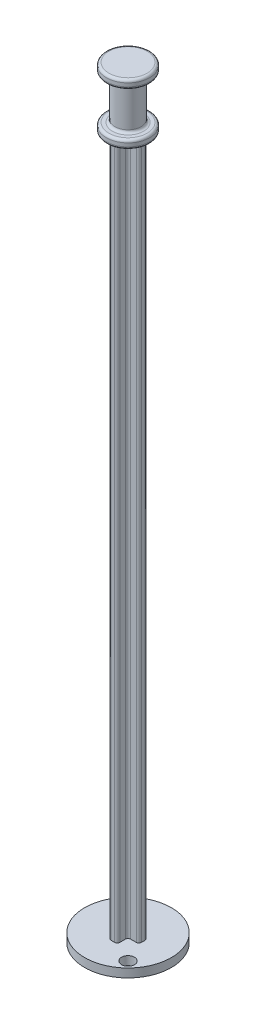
from build123d import *

# Parameters (mm, degrees)
AUFSATZ_LINEAR_AUSTRAGEN1_DEPTH = 80
SKIZZE3_R                       = 5
AUFSATZ_LINEAR_AUSTRAGEN2_DEPTH = 1
SKIZZE4_R                       = 0.75
SCHNITT_LINEAR_AUSTRAGEN1_DEPTH = 3


with BuildPart() as part:
    # Skizze1 → Rotation1 (revolve)
    with BuildSketch(Plane.XY, mode=Mode.PRIVATE) as rotation1_sk:
        with BuildLine():
            Line((0, 0), (2.2, 0))
            ThreePointArc((2.2, 0), (2.412132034, 0.087867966), (2.5, 0.3))
            Line((2.5, 0.3), (2.5, 0.7))
            ThreePointArc((2.5, 0.7), (2.412132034, 0.912132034), (2.2, 1))
            Line((2.2, 1), (1.8, 1))
            ThreePointArc((1.8, 1), (1.587867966, 1.087867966), (1.5, 1.3))
            Line((1.5, 1.3), (1.5, 5.7))
            ThreePointArc((1.5, 5.7), (1.587867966, 5.912132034), (1.8, 6))
            Line((1.8, 6), (2.2, 6))
            ThreePointArc((2.2, 6), (2.412132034, 6.087867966), (2.5, 6.3))
            Line((2.5, 6.3), (2.5, 6.7))
            ThreePointArc((2.5, 6.7), (2.412132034, 6.912132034), (2.2, 7))
            Line((2.2, 7), (0, 7))
            Line((0, 7), (0, 0))
        make_face()
    revolve(rotation1_sk.sketch.rotate(Axis((0, 0, 0), (0, 1, 0)), 90), axis=Axis((0, 0, 0), (0, 1, 0)))


with BuildPart() as body_2:
    # Skizze2 → Aufsatz-Linear austragen1 (new body)
    with BuildSketch(Plane(origin=(0, 0, 0), x_dir=(-1, 0, 0), z_dir=(0, -1, 0))):
        with BuildLine():
            Line((0.5, -1.45), (0.5, -0.8))
            ThreePointArc((0.5, -0.8), (0.587867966, -0.587867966), (0.8, -0.5))
            Line((0.8, -0.5), (1.45, -0.5))
            ThreePointArc((1.45, -0.5), (1.662132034, -0.412132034), (1.75, -0.2))
            Line((1.75, -0.2), (1.75, 0.2))
            ThreePointArc((1.75, 0.2), (1.662132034, 0.412132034), (1.45, 0.5))
            Line((1.45, 0.5), (0.8, 0.5))
            ThreePointArc((0.8, 0.5), (0.587867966, 0.587867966), (0.5, 0.8))
            Line((0.5, 0.8), (0.5, 1.45))
            ThreePointArc((0.5, 1.45), (0.412132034, 1.662132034), (0.2, 1.75))
            Line((0.2, 1.75), (-0.2, 1.75))
            ThreePointArc((-0.2, 1.75), (-0.412132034, 1.662132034), (-0.5, 1.45))
            Line((-0.5, 1.45), (-0.5, 0.8))
            ThreePointArc((-0.5, 0.8), (-0.587867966, 0.587867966), (-0.8, 0.5))
            Line((-0.8, 0.5), (-1.45, 0.5))
            ThreePointArc((-1.45, 0.5), (-1.662132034, 0.412132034), (-1.75, 0.2))
            Line((-1.75, 0.2), (-1.75, -0.2))
            ThreePointArc((-1.75, -0.2), (-1.662132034, -0.412132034), (-1.45, -0.5))
            Line((-1.45, -0.5), (-0.8, -0.5))
            ThreePointArc((-0.8, -0.5), (-0.587867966, -0.587867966), (-0.5, -0.8))
            Line((-0.5, -0.8), (-0.5, -1.45))
            ThreePointArc((-0.5, -1.45), (-0.412132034, -1.662132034), (-0.2, -1.75))
            Line((-0.2, -1.75), (0.2, -1.75))
            ThreePointArc((0.2, -1.75), (0.412132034, -1.662132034), (0.5, -1.45))
        make_face()
    extrude(amount=AUFSATZ_LINEAR_AUSTRAGEN1_DEPTH)


with BuildPart() as body_3:
    # Skizze3 → Aufsatz-Linear austragen2 (new body)
    with BuildSketch(Plane(origin=(0, -80, 0), x_dir=(-1, 0, 0), z_dir=(0, -1, 0))):
        with Locations(Location((0, 0, 0), (0, 0, 90))):
            Circle(SKIZZE3_R)
    extrude(amount=AUFSATZ_LINEAR_AUSTRAGEN2_DEPTH)

    # Skizze4 → Schnitt-Linear austragen1 (cut)
    with BuildSketch(Plane.XZ.offset(81)):
        with Locations(Location((2.828427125, 2.828427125, 0), (0, 0, 270))):
            Circle(SKIZZE4_R)
    extrude(amount=-SCHNITT_LINEAR_AUSTRAGEN1_DEPTH, mode=Mode.SUBTRACT)


solid = Compound([part.part, body_2.part, body_3.part])
